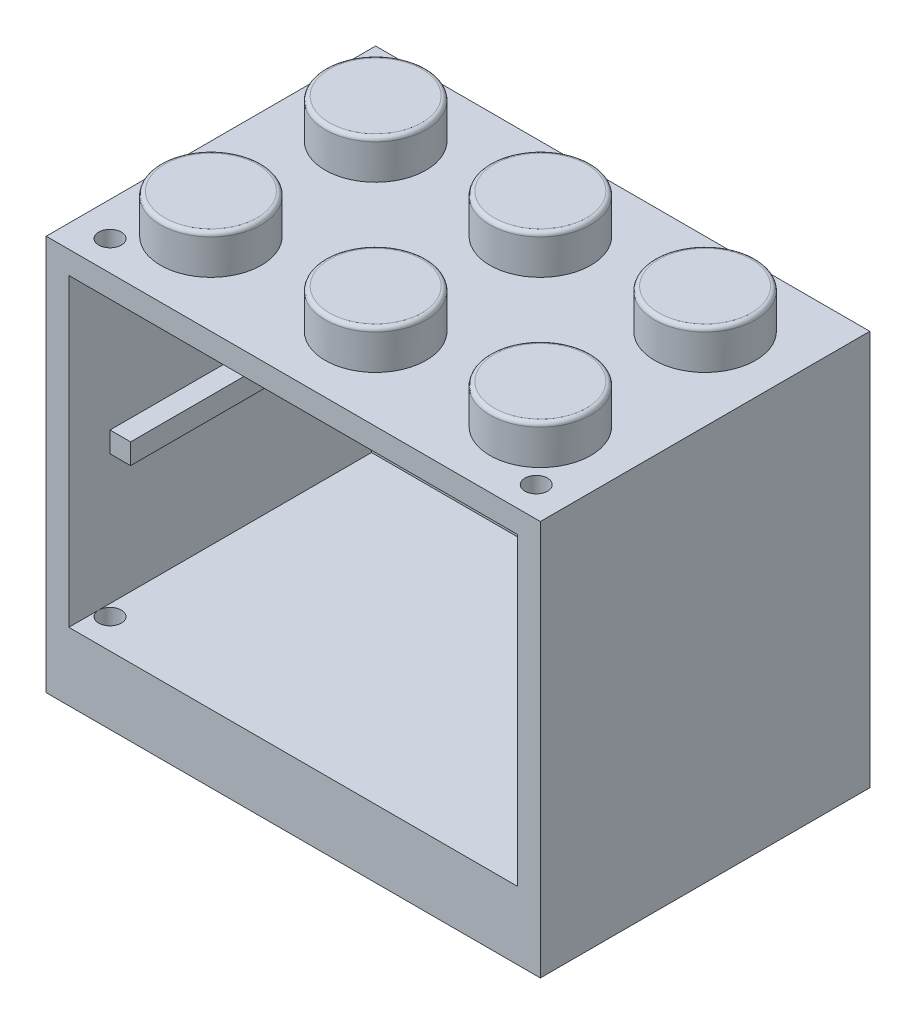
from build123d import *

# Parameters (mm, degrees)
SKIZZE1_W                       = 24
SKIZZE1_H                       = 19.2
LINEAR_AUSTRAGEN1_DEPTH         = 16
SKIZZE3_W                       = 20.8
SKIZZE3_H                       = 12.8
SCHNITT_LINEAR_AUSTRAGEN1_DEPTH = 2.1
SKIZZE5_R                       = 3.25
SKIZZE5_R_2                     = 2.45
LINEAR_AUSTRAGEN2_DEPTH         = 2
SKIZZE6_R                       = 2.45
LINEAR_AUSTRAGEN3_DEPTH         = 1.9
VERRUNDUNG1_R                   = 0.2
SKIZZE7_W                       = 21.8
SKIZZE7_H                       = 14.8
SCHNITT_LINEAR_AUSTRAGEN2_DEPTH = 14.7
SKIZZE8_R                       = 0.55
SCHNITT_LINEAR_AUSTRAGEN3_DEPTH = 36.738074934
SKIZZE9_W                       = 0.5
SKIZZE9_H                       = 1
SKIZZE9_W_2                     = 1
LINEAR_AUSTRAGEN5_DEPTH         = 12.7
VERRUNDUNG3_R                   = 0.2
VERRUNDUNG4_R                   = 0.1
VERRUNDUNG5_R                   = 0.1


with BuildPart() as part:
    # Skizze1 → Linear austragen1 (new body)
    with BuildSketch(Plane.XY):
        with Locations((12, 9.6)):
            Rectangle(SKIZZE1_W, SKIZZE1_H)
    extrude(amount=LINEAR_AUSTRAGEN1_DEPTH)

    # Skizze3 → Schnitt-Linear austragen1 (cut)
    with BuildSketch(Plane.XZ):
        with Locations((12, 8)):
            Rectangle(SKIZZE3_W, SKIZZE3_H)
    extrude(amount=-SCHNITT_LINEAR_AUSTRAGEN1_DEPTH, mode=Mode.SUBTRACT)

    # Skizze5 → Linear austragen2 (add)
    # profile 1 of 2: a face of its own
    with BuildSketch(Plane.XZ.offset(-2.1)):
        with Locations(Location((8, 8, 0), (0, 0, 270))):
            Circle(SKIZZE5_R)
        with Locations(Location((8, 8, 0), (0, 0, 270))):
            Circle(SKIZZE5_R_2, mode=Mode.SUBTRACT)
    # profile 2 of 2: a face of its own
    with BuildSketch(Plane.XZ.offset(-2.1)):
        with Locations(Location((16, 8, 0), (0, 0, 270))):
            Circle(SKIZZE5_R)
        with Locations(Location((16, 8, 0), (0, 0, 270))):
            Circle(SKIZZE5_R_2, mode=Mode.SUBTRACT)
    extrude(amount=LINEAR_AUSTRAGEN2_DEPTH)

    # Skizze6 → Linear austragen3 (add)
    with BuildSketch(Plane(origin=(0, 19.2, 0), x_dir=(-1, 0, 0), z_dir=(0, 1, 0))):
        with Locations(Location((-4, 4, 0), (0, 0, 270))):
            Circle(SKIZZE6_R)
        with Locations(Location((-12, 4, 0), (0, 0, 270))):
            Circle(SKIZZE6_R)
        with Locations(Location((-20, 4, 0), (0, 0, 270))):
            Circle(SKIZZE6_R)
        with Locations(Location((-4, 12, 0), (0, 0, 270))):
            Circle(SKIZZE6_R)
        with Locations(Location((-12, 12, 0), (0, 0, 270))):
            Circle(SKIZZE6_R)
        with Locations(Location((-20, 12, 0), (0, 0, 270))):
            Circle(SKIZZE6_R)
    extrude(amount=LINEAR_AUSTRAGEN3_DEPTH)

    # Verrundung1
    verrundung1_edges = [part.edges().sort_by_distance(p)[0] for p in [
        (4, 21.1, 6.45),
        (12, 21.1, 6.45),
        (20, 21.1, 6.45),
        (4, 21.1, 14.45),
        (12, 21.1, 14.45),
        (20, 21.1, 14.45),
    ]]
    fillet(verrundung1_edges, radius=VERRUNDUNG1_R)

    # Skizze7 → Schnitt-Linear austragen2 (cut)
    with BuildSketch(Plane.XY.offset(16)):
        with Locations((12, 10.7)):
            Rectangle(SKIZZE7_W, SKIZZE7_H)
    extrude(amount=-SCHNITT_LINEAR_AUSTRAGEN2_DEPTH, mode=Mode.SUBTRACT)

    # Skizze8 → Schnitt-Linear austragen3 (cut, through all)
    with BuildSketch(Plane.XZ):
        with Locations(Location((1.65, 14.55, 0), (0, 0, 264.78409143))):
            Circle(SKIZZE8_R)
        with Locations(Location((22.35, 14.55, 0), (0, 0, 275.21590857))):
            Circle(SKIZZE8_R)
    extrude(amount=-SCHNITT_LINEAR_AUSTRAGEN3_DEPTH, mode=Mode.SUBTRACT)

    # Skizze9 → Linear austragen5 (add)
    with BuildSketch(Plane.XY.offset(1.3)):
        with Locations((1.35, 17.6)):
            Rectangle(SKIZZE9_W, SKIZZE9_H)
        with Locations((22.65, 17.6)):
            Rectangle(SKIZZE9_W, SKIZZE9_H)
        with Locations((1.6, 10.1)):
            Rectangle(SKIZZE9_W_2, SKIZZE9_H)
        with Locations((22.4, 10.1)):
            Rectangle(SKIZZE9_W_2, SKIZZE9_H)
    extrude(amount=LINEAR_AUSTRAGEN5_DEPTH)

    # Verrundung3
    verrundung3_edges = [part.edges().sort_by_distance(p)[0] for p in [
        (21.9, 10.1, 14),
    ]]
    fillet(verrundung3_edges, radius=VERRUNDUNG3_R)

    # Verrundung4
    verrundung4_edges = [part.edges().sort_by_distance(p)[0] for p in [
        (22.4, 17.6, 14),
    ]]
    fillet(verrundung4_edges, radius=VERRUNDUNG4_R)

    # Verrundung5
    verrundung5_edges = [part.edges().sort_by_distance(p)[0] for p in [
        (1.6, 17.6, 14),
    ]]
    fillet(verrundung5_edges, radius=VERRUNDUNG5_R)


solid = part.part
